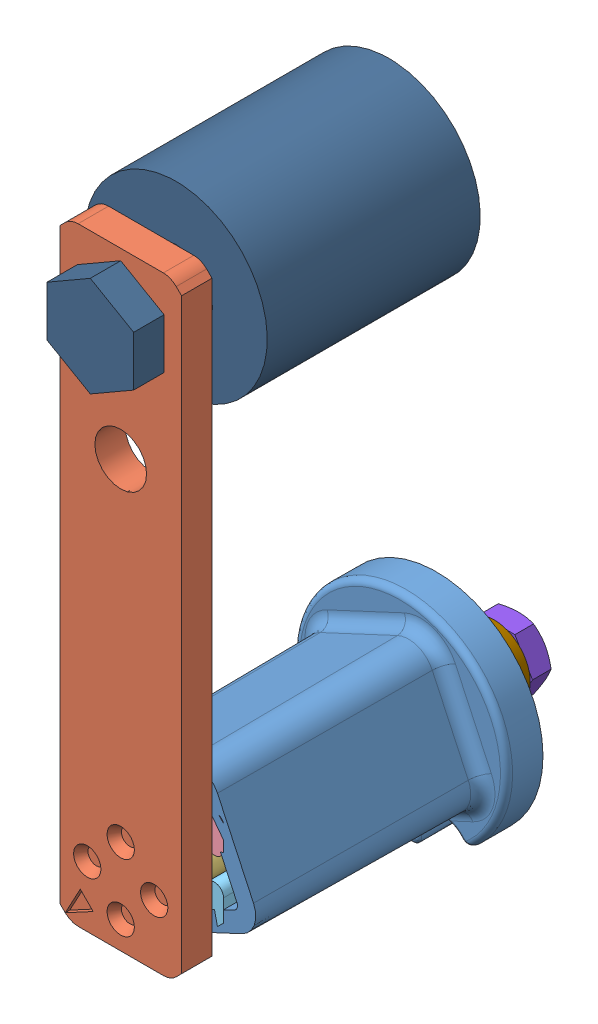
SolidWorks assembly timing assembly tensioner.SLDASM, configuration Default (file format 12000). Lengths in mm.
Overall size (46.22 116.68 69.97).
10 component instances, 10 part files, 2 mates.
Components (placement in the parent):
- SE11_060110011-1: SE11_060110011.sldprt [Default] x (0.906308 0.422618 0) z (0 0 1) size (35 34.3 43)
- SE11_060110012-1: SE11_060110012.sldprt [Default] at (-0.4261 -0.9407 0.468) size (20 100 6.2)
- SE11_060110013-1: SE11_060110013.sldprt [Default] at origin size (13.49 13.49 35)
- SE11_060110014-1: SE11_060110014.sldprt [Default] at origin size (6.1 6.1 32)
- SE11_060110015-1: SE11_060110015.sldprt [Default] at origin size (6.1 6.1 32)
- SE11_060110016-1: SE11_060110016.sldprt [Default] at origin size (6.1 6.1 32)
- SE11_060110017-1: SE11_060110017.sldprt [Default] at origin size (6.1 6.1 32)
- SE11_060110019-1: SE11_060110019.sldprt [Default] at origin size (11.55 10 24)
- SE11_0601100110-1: SE11_0601100110.sldprt [Default] at origin size (11.8 11.8 1.6)
- rotary tensioner idler-1: rotary tensioner idler.SLDPRT [Default] at (-0.4261 79.0593 45.388) x (1 0 0) z (0 1 0) size (30 49.08 30)
Mates (geometry in assembly coordinates):
- Coincident1: coincident anti-aligned: plane of SE11_060110012-1 through (-10.4361 -10.9507 51.468) normal (0 0 1); plane of rotary tensioner idler-1 through (-0.4261 79.0593 51.468) normal (0 0 -1)
- Concentric1: concentric anti-aligned: cylinder of SE11_060110012-1 through (-0.4261 79.0593 46.468) axis (0 0 1) radius 4.25; cylinder of rotary tensioner idler-1 through (-0.4261 79.0593 56.468) axis (0 0 -1) radius 4
